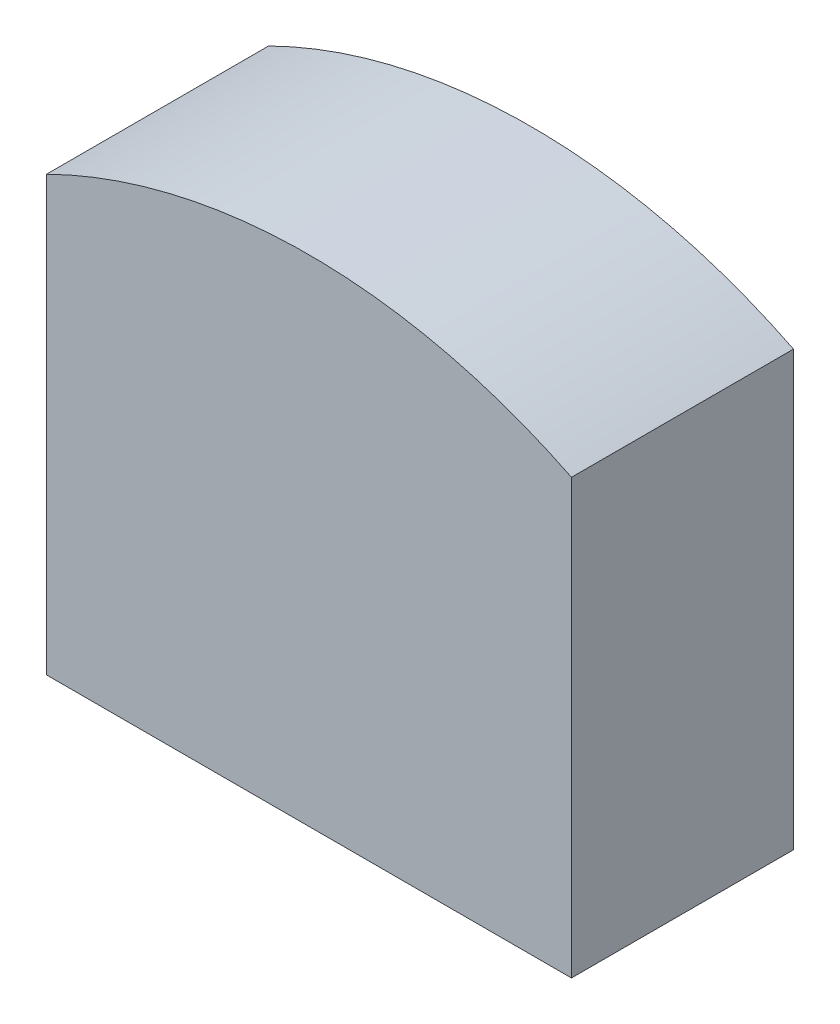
ISO-10303-21;
HEADER;
FILE_DESCRIPTION(('STEP AP214'),'2;1');
FILE_NAME('part.step','',(''),(''),'','','');
FILE_SCHEMA(('AUTOMOTIVE_DESIGN { 1 0 10303 214 1 1 1 1 }'));
ENDSEC;
DATA;
#1=APPLICATION_CONTEXT('core data for automotive mechanical design processes');
#2=APPLICATION_PROTOCOL_DEFINITION('international standard','automotive_design',2000,#1);
#3=PRODUCT_CONTEXT('',#1,'mechanical');
#4=PRODUCT('Part','Part','',(#3));
#5=PRODUCT_RELATED_PRODUCT_CATEGORY('part','',(#4));
#6=PRODUCT_DEFINITION_FORMATION('','',#4);
#7=PRODUCT_DEFINITION_CONTEXT('part definition',#1,'design');
#8=PRODUCT_DEFINITION('design','',#6,#7);
#9=PRODUCT_DEFINITION_SHAPE('','',#8);
#10=(LENGTH_UNIT() NAMED_UNIT(*) SI_UNIT(.MILLI.,.METRE.));
#11=(NAMED_UNIT(*) PLANE_ANGLE_UNIT() SI_UNIT($,.RADIAN.));
#12=(NAMED_UNIT(*) SI_UNIT($,.STERADIAN.) SOLID_ANGLE_UNIT());
#13=UNCERTAINTY_MEASURE_WITH_UNIT(LENGTH_MEASURE(1.E-05),#10,'distance_accuracy_value','');
#14=(GEOMETRIC_REPRESENTATION_CONTEXT(3) GLOBAL_UNCERTAINTY_ASSIGNED_CONTEXT((#13)) GLOBAL_UNIT_ASSIGNED_CONTEXT((#10,
#11,#12)) REPRESENTATION_CONTEXT('',''));
#15=CARTESIAN_POINT('',(0.,0.,0.));
#16=DIRECTION('',(0.,0.,1.));
#17=DIRECTION('',(1.,0.,0.));
#18=AXIS2_PLACEMENT_3D('',#15,#16,#17);
#19=CARTESIAN_POINT('',(0.,0.,10.7442));
#20=DIRECTION('',(0.,0.,-1.));
#21=DIRECTION('',(-1.,0.,0.));
#22=AXIS2_PLACEMENT_3D('',#19,#20,#21);
#23=CYLINDRICAL_SURFACE('',#22,28.575);
#24=DIRECTION('',(0.,0.,1.));
#25=VECTOR('',#24,1.);
#26=CARTESIAN_POINT('',(-12.7,25.5976683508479,-0.330200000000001));
#27=LINE('',#26,#25);
#28=CARTESIAN_POINT('',(-12.7,25.5976683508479,0.));
#29=VERTEX_POINT('',#28);
#30=CARTESIAN_POINT('',(-12.7,25.5976683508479,10.7442));
#31=VERTEX_POINT('',#30);
#32=EDGE_CURVE('E52',#29,#31,#27,.T.);
#33=ORIENTED_EDGE('',*,*,#32,.T.);
#34=CARTESIAN_POINT('',(0.,0.,10.7442));
#35=DIRECTION('',(0.,0.,1.));
#36=DIRECTION('',(1.,0.,0.));
#37=AXIS2_PLACEMENT_3D('',#34,#35,#36);
#38=CIRCLE('',#37,28.575);
#39=CARTESIAN_POINT('',(12.7,25.5976683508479,10.7442));
#40=VERTEX_POINT('',#39);
#41=EDGE_CURVE('E100',#40,#31,#38,.T.);
#42=ORIENTED_EDGE('',*,*,#41,.F.);
#43=DIRECTION('',(0.,0.,1.));
#44=VECTOR('',#43,1.);
#45=CARTESIAN_POINT('',(12.7,25.5976683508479,-0.330200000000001));
#46=LINE('',#45,#44);
#47=CARTESIAN_POINT('',(12.7,25.5976683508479,0.));
#48=VERTEX_POINT('',#47);
#49=EDGE_CURVE('E79',#48,#40,#46,.T.);
#50=ORIENTED_EDGE('',*,*,#49,.F.);
#51=CARTESIAN_POINT('',(0.,0.,0.));
#52=DIRECTION('',(0.,0.,1.));
#53=DIRECTION('',(1.,0.,0.));
#54=AXIS2_PLACEMENT_3D('',#51,#52,#53);
#55=CIRCLE('',#54,28.575);
#56=EDGE_CURVE('E95',#48,#29,#55,.T.);
#57=ORIENTED_EDGE('',*,*,#56,.T.);
#58=EDGE_LOOP('',(#33,#42,#50,#57));
#59=FACE_BOUND('',#58,.T.);
#60=ADVANCED_FACE('F32',(#59),#23,.T.);
#61=CARTESIAN_POINT('',(0.,0.,10.7442));
#62=DIRECTION('',(0.,0.,1.));
#63=DIRECTION('',(1.,0.,0.));
#64=AXIS2_PLACEMENT_3D('',#61,#62,#63);
#65=PLANE('',#64);
#66=ORIENTED_EDGE('',*,*,#41,.T.);
#67=DIRECTION('',(0.,-1.,0.));
#68=VECTOR('',#67,1.);
#69=CARTESIAN_POINT('',(-12.7,4.6172683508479,10.7442));
#70=LINE('',#69,#68);
#71=CARTESIAN_POINT('',(-12.7,4.6172683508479,10.7442));
#72=VERTEX_POINT('',#71);
#73=EDGE_CURVE('E90',#31,#72,#70,.T.);
#74=ORIENTED_EDGE('',*,*,#73,.T.);
#75=DIRECTION('',(1.,0.,0.));
#76=VECTOR('',#75,1.);
#77=CARTESIAN_POINT('',(12.7,4.61726835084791,10.7442));
#78=LINE('',#77,#76);
#79=CARTESIAN_POINT('',(12.7,4.61726835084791,10.7442));
#80=VERTEX_POINT('',#79);
#81=EDGE_CURVE('E73',#72,#80,#78,.T.);
#82=ORIENTED_EDGE('',*,*,#81,.T.);
#83=DIRECTION('',(0.,1.,0.));
#84=VECTOR('',#83,1.);
#85=CARTESIAN_POINT('',(12.7,4.61726835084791,10.7442));
#86=LINE('',#85,#84);
#87=EDGE_CURVE('E82',#80,#40,#86,.T.);
#88=ORIENTED_EDGE('',*,*,#87,.T.);
#89=EDGE_LOOP('',(#66,#74,#82,#88));
#90=FACE_BOUND('',#89,.T.);
#91=ADVANCED_FACE('F89',(#90),#65,.T.);
#92=CARTESIAN_POINT('',(0.,0.,0.));
#93=DIRECTION('',(0.,0.,1.));
#94=DIRECTION('',(1.,0.,0.));
#95=AXIS2_PLACEMENT_3D('',#92,#93,#94);
#96=PLANE('',#95);
#97=DIRECTION('',(0.,-1.,0.));
#98=VECTOR('',#97,1.);
#99=CARTESIAN_POINT('',(-12.7,0.,0.));
#100=LINE('',#99,#98);
#101=CARTESIAN_POINT('',(-12.7,4.6172683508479,0.));
#102=VERTEX_POINT('',#101);
#103=EDGE_CURVE('E12',#29,#102,#100,.T.);
#104=ORIENTED_EDGE('',*,*,#103,.F.);
#105=ORIENTED_EDGE('',*,*,#56,.F.);
#106=DIRECTION('',(0.,1.,0.));
#107=VECTOR('',#106,1.);
#108=CARTESIAN_POINT('',(12.7,0.,0.));
#109=LINE('',#108,#107);
#110=CARTESIAN_POINT('',(12.7,4.61726835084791,0.));
#111=VERTEX_POINT('',#110);
#112=EDGE_CURVE('E39',#111,#48,#109,.T.);
#113=ORIENTED_EDGE('',*,*,#112,.F.);
#114=DIRECTION('',(1.,0.,0.));
#115=VECTOR('',#114,1.);
#116=CARTESIAN_POINT('',(0.,4.61726835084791,0.));
#117=LINE('',#116,#115);
#118=EDGE_CURVE('E76',#102,#111,#117,.T.);
#119=ORIENTED_EDGE('',*,*,#118,.F.);
#120=EDGE_LOOP('',(#104,#105,#113,#119));
#121=FACE_BOUND('',#120,.T.);
#122=ADVANCED_FACE('F105',(#121),#96,.F.);
#123=CARTESIAN_POINT('',(-12.7,4.6172683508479,-0.330200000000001));
#124=DIRECTION('',(-1.,0.,0.));
#125=DIRECTION('',(0.,-1.,0.));
#126=AXIS2_PLACEMENT_3D('',#123,#124,#125);
#127=PLANE('',#126);
#128=ORIENTED_EDGE('',*,*,#103,.T.);
#129=DIRECTION('',(0.,0.,1.));
#130=VECTOR('',#129,1.);
#131=CARTESIAN_POINT('',(-12.7,4.6172683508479,-0.330200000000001));
#132=LINE('',#131,#130);
#133=EDGE_CURVE('E46',#102,#72,#132,.T.);
#134=ORIENTED_EDGE('',*,*,#133,.T.);
#135=ORIENTED_EDGE('',*,*,#73,.F.);
#136=ORIENTED_EDGE('',*,*,#32,.F.);
#137=EDGE_LOOP('',(#128,#134,#135,#136));
#138=FACE_BOUND('',#137,.T.);
#139=ADVANCED_FACE('F106',(#138),#127,.T.);
#140=CARTESIAN_POINT('',(12.7,4.61726835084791,-0.330200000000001));
#141=DIRECTION('',(1.,0.,0.));
#142=DIRECTION('',(0.,1.,0.));
#143=AXIS2_PLACEMENT_3D('',#140,#141,#142);
#144=PLANE('',#143);
#145=ORIENTED_EDGE('',*,*,#112,.T.);
#146=ORIENTED_EDGE('',*,*,#49,.T.);
#147=ORIENTED_EDGE('',*,*,#87,.F.);
#148=DIRECTION('',(0.,0.,1.));
#149=VECTOR('',#148,1.);
#150=CARTESIAN_POINT('',(12.7,4.61726835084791,-0.330200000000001));
#151=LINE('',#150,#149);
#152=EDGE_CURVE('E69',#111,#80,#151,.T.);
#153=ORIENTED_EDGE('',*,*,#152,.F.);
#154=EDGE_LOOP('',(#145,#146,#147,#153));
#155=FACE_BOUND('',#154,.T.);
#156=ADVANCED_FACE('F83',(#155),#144,.T.);
#157=CARTESIAN_POINT('',(12.7,4.61726835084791,-0.330200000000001));
#158=DIRECTION('',(0.,-1.,0.));
#159=DIRECTION('',(1.,0.,0.));
#160=AXIS2_PLACEMENT_3D('',#157,#158,#159);
#161=PLANE('',#160);
#162=ORIENTED_EDGE('',*,*,#118,.T.);
#163=ORIENTED_EDGE('',*,*,#152,.T.);
#164=ORIENTED_EDGE('',*,*,#81,.F.);
#165=ORIENTED_EDGE('',*,*,#133,.F.);
#166=EDGE_LOOP('',(#162,#163,#164,#165));
#167=FACE_BOUND('',#166,.T.);
#168=ADVANCED_FACE('F71',(#167),#161,.T.);
#169=CLOSED_SHELL('',(#60,#91,#122,#139,#156,#168));
#170=MANIFOLD_SOLID_BREP('B2',#169);
#171=ADVANCED_BREP_SHAPE_REPRESENTATION('',(#18,#170),#14);
#172=SHAPE_DEFINITION_REPRESENTATION(#9,#171);
ENDSEC;
END-ISO-10303-21;
